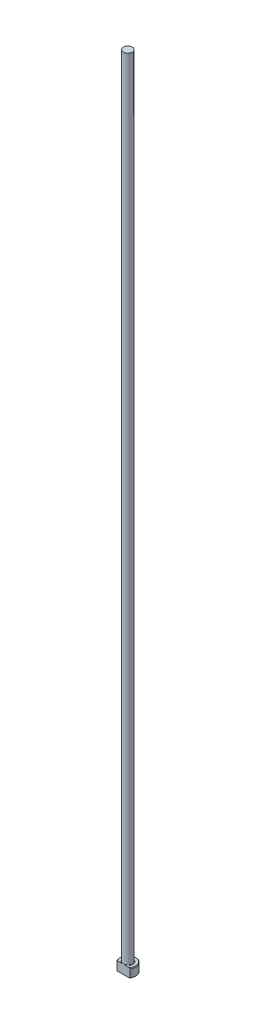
from build123d import *

# Parameters (mm, degrees)
CHAMFER1_SIZE = 0.254
FILLET1_R     = 0.254
KEY_DEPTH     = 356.63581265


with BuildPart() as part:
    # Sketch1 → Revolve1 (revolve)
    with BuildSketch(Plane.XY, mode=Mode.PRIVATE) as revolve1_sk:
        Polygon((0, 0), (-3.5687, 0), (-3.5687, 3.9624), (-1.98374, 3.9624), (-1.98374, 355.6), (0, 355.6), align=None)
    revolve(revolve1_sk.sketch.rotate(Axis((0, 259.958771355, 0), (0, -1, 0)), 270), axis=Axis((0, 259.958771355, 0), (0, -1, 0)))

    # Chamfer1
    chamfer1_edges = [part.edges().sort_by_distance(p)[0] for p in [
        (0, 3.9624, -3.5687),
        (0, 0, -3.5687),
    ]]
    chamfer(chamfer1_edges, length=CHAMFER1_SIZE)

    # Fillet1
    fillet1_edges = [part.edges().sort_by_distance(p)[0] for p in [
        (0, 3.9624, -1.98374),
    ]]
    fillet(fillet1_edges, radius=FILLET1_R)

    # Sketch2 → Key (cut, through all)
    with BuildSketch(Plane(origin=(0, 0, 0), x_dir=(1, 0, 0), z_dir=(0, 1, 0))):
        with BuildLine():
            Line((-2.966546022, -1.98374), (2.966546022, -1.98374))
            ThreePointArc((2.966546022, -1.98374), (0, -3.5687), (-2.966546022, -1.98374))
        make_face()
    extrude(amount=KEY_DEPTH, mode=Mode.SUBTRACT)


solid = part.part
